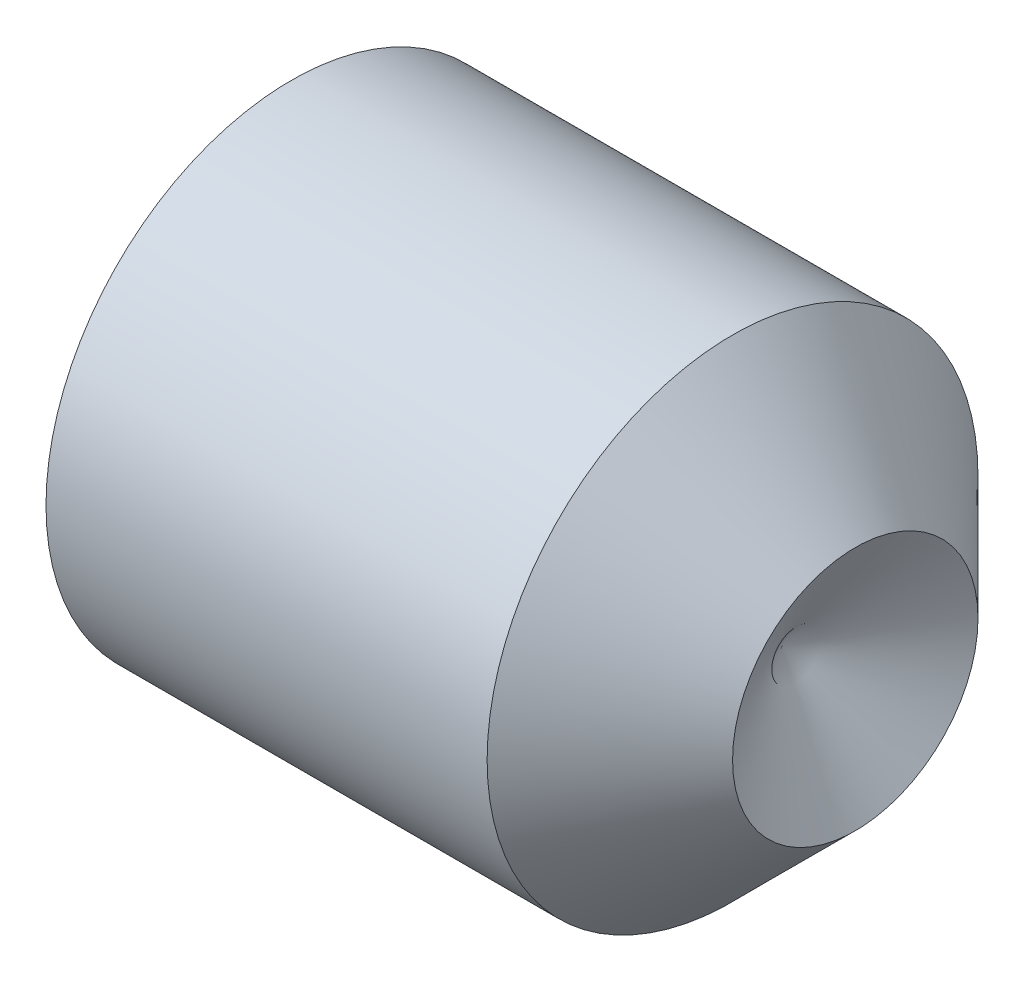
from build123d import *

# Parameters (mm, degrees)
HEX_2_DEPTH = 2.7


with BuildPart() as part:
    # BodySke → BaseBody (revolve)
    with BuildSketch(Plane.XY, mode=Mode.PRIVATE) as basebody_sk:
        Polygon((0, 0), (0, 2.055), (0.25692087, 2.5), (4.75, 2.5), (6, 1.25), (5.248924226, 0), align=None)
    revolve(basebody_sk.sketch.rotate(Axis((-12.7, 0, 0), (1, 0, 0)), 90), axis=Axis((-12.7, 0, 0), (1, 0, 0)))

    # Sketch2 → Hex 2 (cut)
    with BuildSketch(Plane.ZY):
        Polygon((0.721687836, 1.25), (-0.721687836, 1.25), (-1.443375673, 0), (-0.721687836, -1.25), (0.721687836, -1.25), (1.443375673, 0), align=None)
    extrude(amount=-HEX_2_DEPTH, mode=Mode.SUBTRACT)


solid = part.part
